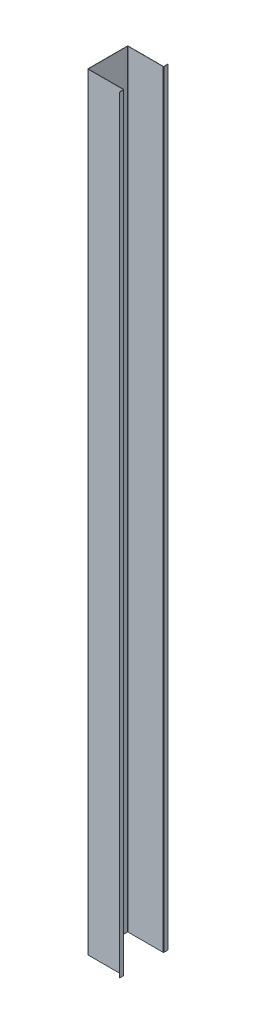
ISO-10303-21;
HEADER;
FILE_DESCRIPTION(('STEP AP214'),'2;1');
FILE_NAME('part.step','',(''),(''),'','','');
FILE_SCHEMA(('AUTOMOTIVE_DESIGN { 1 0 10303 214 1 1 1 1 }'));
ENDSEC;
DATA;
#1=APPLICATION_CONTEXT('core data for automotive mechanical design processes');
#2=APPLICATION_PROTOCOL_DEFINITION('international standard','automotive_design',2000,#1);
#3=PRODUCT_CONTEXT('',#1,'mechanical');
#4=PRODUCT('Part','Part','',(#3));
#5=PRODUCT_RELATED_PRODUCT_CATEGORY('part','',(#4));
#6=PRODUCT_DEFINITION_FORMATION('','',#4);
#7=PRODUCT_DEFINITION_CONTEXT('part definition',#1,'design');
#8=PRODUCT_DEFINITION('design','',#6,#7);
#9=PRODUCT_DEFINITION_SHAPE('','',#8);
#10=(LENGTH_UNIT() NAMED_UNIT(*) SI_UNIT(.MILLI.,.METRE.));
#11=(NAMED_UNIT(*) PLANE_ANGLE_UNIT() SI_UNIT($,.RADIAN.));
#12=(NAMED_UNIT(*) SI_UNIT($,.STERADIAN.) SOLID_ANGLE_UNIT());
#13=UNCERTAINTY_MEASURE_WITH_UNIT(LENGTH_MEASURE(1.E-05),#10,'distance_accuracy_value','');
#14=(GEOMETRIC_REPRESENTATION_CONTEXT(3) GLOBAL_UNCERTAINTY_ASSIGNED_CONTEXT((#13)) GLOBAL_UNIT_ASSIGNED_CONTEXT((#10,
#11,#12)) REPRESENTATION_CONTEXT('',''));
#15=CARTESIAN_POINT('',(0.,0.,0.));
#16=DIRECTION('',(0.,0.,1.));
#17=DIRECTION('',(1.,0.,0.));
#18=AXIS2_PLACEMENT_3D('',#15,#16,#17);
#19=CARTESIAN_POINT('',(-91.9999999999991,-962.599999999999,-0.6));
#20=DIRECTION('',(0.,-1.,0.));
#21=DIRECTION('',(0.,0.,-1.));
#22=AXIS2_PLACEMENT_3D('',#19,#20,#21);
#23=PLANE('',#22);
#24=DIRECTION('',(1.,0.,0.));
#25=VECTOR('',#24,1.);
#26=CARTESIAN_POINT('',(-91.9999999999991,-962.599999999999,-0.6));
#27=LINE('',#26,#25);
#28=CARTESIAN_POINT('',(-90.3999999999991,-962.599999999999,-0.600000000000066));
#29=VERTEX_POINT('',#28);
#30=CARTESIAN_POINT('',(-2.79999999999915,-962.599999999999,-0.599999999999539));
#31=VERTEX_POINT('',#30);
#32=EDGE_CURVE('E126',#29,#31,#27,.T.);
#33=ORIENTED_EDGE('',*,*,#32,.T.);
#34=DIRECTION('',(-3.00540842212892E-13,0.,1.));
#35=VECTOR('',#34,1.);
#36=CARTESIAN_POINT('',(-2.79999999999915,-962.599999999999,-0.599999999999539));
#37=LINE('',#36,#35);
#38=CARTESIAN_POINT('',(-2.79999999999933,-962.599999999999,4.61436444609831E-13));
#39=VERTEX_POINT('',#38);
#40=EDGE_CURVE('E306',#31,#39,#37,.T.);
#41=ORIENTED_EDGE('',*,*,#40,.T.);
#42=DIRECTION('',(1.,0.,0.));
#43=VECTOR('',#42,1.);
#44=CARTESIAN_POINT('',(-91.9999999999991,-962.599999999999,0.));
#45=LINE('',#44,#43);
#46=CARTESIAN_POINT('',(-90.3999999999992,-962.599999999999,0.));
#47=VERTEX_POINT('',#46);
#48=EDGE_CURVE('E455',#47,#39,#45,.T.);
#49=ORIENTED_EDGE('',*,*,#48,.F.);
#50=DIRECTION('',(1.11022302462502E-13,0.,-1.));
#51=VECTOR('',#50,1.);
#52=CARTESIAN_POINT('',(-90.3999999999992,-962.599999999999,0.));
#53=LINE('',#52,#51);
#54=EDGE_CURVE('E441',#47,#29,#53,.T.);
#55=ORIENTED_EDGE('',*,*,#54,.T.);
#56=EDGE_LOOP('',(#33,#41,#49,#55));
#57=FACE_BOUND('',#56,.T.);
#58=ADVANCED_FACE('F118',(#57),#23,.T.);
#59=CARTESIAN_POINT('',(0.,0.,-0.6));
#60=DIRECTION('',(0.,0.,1.));
#61=DIRECTION('',(1.,0.,0.));
#62=AXIS2_PLACEMENT_3D('',#59,#60,#61);
#63=PLANE('',#62);
#64=DIRECTION('',(0.,-1.,0.));
#65=VECTOR('',#64,1.);
#66=CARTESIAN_POINT('',(-2.79999999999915,-962.599999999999,-0.599999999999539));
#67=LINE('',#66,#65);
#68=CARTESIAN_POINT('',(-2.79999999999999,967.6,-0.599999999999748));
#69=VERTEX_POINT('',#68);
#70=EDGE_CURVE('E312',#31,#69,#67,.F.);
#71=ORIENTED_EDGE('',*,*,#70,.F.);
#72=ORIENTED_EDGE('',*,*,#32,.F.);
#73=DIRECTION('',(0.,-1.,0.));
#74=VECTOR('',#73,1.);
#75=CARTESIAN_POINT('',(-90.3999999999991,-962.599999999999,-0.600000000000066));
#76=LINE('',#75,#74);
#77=CARTESIAN_POINT('',(-90.3999999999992,967.6,-0.6));
#78=VERTEX_POINT('',#77);
#79=EDGE_CURVE('E434',#29,#78,#76,.F.);
#80=ORIENTED_EDGE('',*,*,#79,.T.);
#81=DIRECTION('',(-1.,0.,0.));
#82=VECTOR('',#81,1.);
#83=CARTESIAN_POINT('',(-91.9999999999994,967.6,-0.6));
#84=LINE('',#83,#82);
#85=EDGE_CURVE('E13',#69,#78,#84,.T.);
#86=ORIENTED_EDGE('',*,*,#85,.F.);
#87=EDGE_LOOP('',(#71,#72,#80,#86));
#88=FACE_BOUND('',#87,.T.);
#89=ADVANCED_FACE('F529',(#88),#63,.F.);
#90=CARTESIAN_POINT('',(0.,0.,0.));
#91=DIRECTION('',(0.,0.,1.));
#92=DIRECTION('',(1.,0.,0.));
#93=AXIS2_PLACEMENT_3D('',#90,#91,#92);
#94=PLANE('',#93);
#95=ORIENTED_EDGE('',*,*,#48,.T.);
#96=DIRECTION('',(0.,-1.,0.));
#97=VECTOR('',#96,1.);
#98=CARTESIAN_POINT('',(-2.79999999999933,-962.599999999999,4.61436444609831E-13));
#99=LINE('',#98,#97);
#100=CARTESIAN_POINT('',(-2.79999999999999,967.6,0.));
#101=VERTEX_POINT('',#100);
#102=EDGE_CURVE('E299',#39,#101,#99,.F.);
#103=ORIENTED_EDGE('',*,*,#102,.T.);
#104=DIRECTION('',(-1.,0.,0.));
#105=VECTOR('',#104,1.);
#106=CARTESIAN_POINT('',(-91.9999999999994,967.6,0.));
#107=LINE('',#106,#105);
#108=CARTESIAN_POINT('',(-90.3999999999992,967.6,0.));
#109=VERTEX_POINT('',#108);
#110=EDGE_CURVE('E121',#101,#109,#107,.T.);
#111=ORIENTED_EDGE('',*,*,#110,.T.);
#112=DIRECTION('',(0.,-1.,0.));
#113=VECTOR('',#112,1.);
#114=CARTESIAN_POINT('',(-90.3999999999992,-962.599999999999,0.));
#115=LINE('',#114,#113);
#116=EDGE_CURVE('E447',#47,#109,#115,.F.);
#117=ORIENTED_EDGE('',*,*,#116,.F.);
#118=EDGE_LOOP('',(#95,#103,#111,#117));
#119=FACE_BOUND('',#118,.T.);
#120=ADVANCED_FACE('F464',(#119),#94,.T.);
#121=CARTESIAN_POINT('',(-1.19999999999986,-962.599999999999,100.200000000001));
#122=DIRECTION('',(0.,1.,0.));
#123=DIRECTION('',(0.,0.,1.));
#124=AXIS2_PLACEMENT_3D('',#121,#122,#123);
#125=PLANE('',#124);
#126=DIRECTION('',(-1.11022302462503E-13,0.,-1.));
#127=VECTOR('',#126,1.);
#128=CARTESIAN_POINT('',(-2.80000000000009,-962.599999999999,100.200000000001));
#129=LINE('',#128,#127);
#130=CARTESIAN_POINT('',(-2.80000000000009,-962.599999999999,100.200000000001));
#131=VERTEX_POINT('',#130);
#132=CARTESIAN_POINT('',(-2.80000000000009,-962.599999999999,99.6000000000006));
#133=VERTEX_POINT('',#132);
#134=EDGE_CURVE('E368',#131,#133,#129,.T.);
#135=ORIENTED_EDGE('',*,*,#134,.F.);
#136=DIRECTION('',(1.,0.,0.));
#137=VECTOR('',#136,1.);
#138=CARTESIAN_POINT('',(-6.95830423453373E-13,-962.599999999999,100.200000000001));
#139=LINE('',#138,#137);
#140=CARTESIAN_POINT('',(-90.3999999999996,-962.599999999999,100.2));
#141=VERTEX_POINT('',#140);
#142=EDGE_CURVE('E376',#141,#131,#139,.T.);
#143=ORIENTED_EDGE('',*,*,#142,.F.);
#144=DIRECTION('',(0.,0.,-1.));
#145=VECTOR('',#144,1.);
#146=CARTESIAN_POINT('',(-90.3999999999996,-962.599999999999,99.6));
#147=LINE('',#146,#145);
#148=CARTESIAN_POINT('',(-90.3999999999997,-962.599999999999,99.6));
#149=VERTEX_POINT('',#148);
#150=EDGE_CURVE('E387',#149,#141,#147,.F.);
#151=ORIENTED_EDGE('',*,*,#150,.F.);
#152=DIRECTION('',(-1.,0.,0.));
#153=VECTOR('',#152,1.);
#154=CARTESIAN_POINT('',(-1.19999999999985,-962.599999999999,99.6000000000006));
#155=LINE('',#154,#153);
#156=EDGE_CURVE('E381',#149,#133,#155,.F.);
#157=ORIENTED_EDGE('',*,*,#156,.T.);
#158=EDGE_LOOP('',(#135,#143,#151,#157));
#159=FACE_BOUND('',#158,.T.);
#160=ADVANCED_FACE('F506',(#159),#125,.F.);
#161=CARTESIAN_POINT('',(-91.3999999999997,967.6,100.2));
#162=DIRECTION('',(0.,-1.,0.));
#163=DIRECTION('',(1.,0.,0.));
#164=AXIS2_PLACEMENT_3D('',#161,#162,#163);
#165=PLANE('',#164);
#166=DIRECTION('',(-1.11022302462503E-13,0.,-1.));
#167=VECTOR('',#166,1.);
#168=CARTESIAN_POINT('',(-2.80000000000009,967.6,100.200000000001));
#169=LINE('',#168,#167);
#170=CARTESIAN_POINT('',(-2.80000000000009,967.6,100.200000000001));
#171=VERTEX_POINT('',#170);
#172=CARTESIAN_POINT('',(-2.80000000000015,967.6,99.6000000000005));
#173=VERTEX_POINT('',#172);
#174=EDGE_CURVE('E358',#171,#173,#169,.T.);
#175=ORIENTED_EDGE('',*,*,#174,.T.);
#176=DIRECTION('',(1.,0.,0.));
#177=VECTOR('',#176,1.);
#178=CARTESIAN_POINT('',(-91.3999999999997,967.6,99.6));
#179=LINE('',#178,#177);
#180=CARTESIAN_POINT('',(-90.3999999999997,967.6,99.6));
#181=VERTEX_POINT('',#180);
#182=EDGE_CURVE('E379',#173,#181,#179,.F.);
#183=ORIENTED_EDGE('',*,*,#182,.T.);
#184=DIRECTION('',(0.,0.,-1.));
#185=VECTOR('',#184,1.);
#186=CARTESIAN_POINT('',(-90.3999999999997,967.6,100.2));
#187=LINE('',#186,#185);
#188=CARTESIAN_POINT('',(-90.3999999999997,967.6,100.2));
#189=VERTEX_POINT('',#188);
#190=EDGE_CURVE('E370',#181,#189,#187,.F.);
#191=ORIENTED_EDGE('',*,*,#190,.T.);
#192=DIRECTION('',(-1.,0.,0.));
#193=VECTOR('',#192,1.);
#194=CARTESIAN_POINT('',(-3.07776345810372E-12,967.6,100.200000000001));
#195=LINE('',#194,#193);
#196=EDGE_CURVE('E373',#171,#189,#195,.T.);
#197=ORIENTED_EDGE('',*,*,#196,.F.);
#198=EDGE_LOOP('',(#175,#183,#191,#197));
#199=FACE_BOUND('',#198,.T.);
#200=ADVANCED_FACE('F493',(#199),#165,.F.);
#201=CARTESIAN_POINT('',(-6.95830423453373E-13,0.,100.200000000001));
#202=DIRECTION('',(0.,0.,-1.));
#203=DIRECTION('',(-1.,0.,0.));
#204=AXIS2_PLACEMENT_3D('',#201,#202,#203);
#205=PLANE('',#204);
#206=DIRECTION('',(0.,1.,0.));
#207=VECTOR('',#206,1.);
#208=CARTESIAN_POINT('',(-2.80000000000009,967.6,100.200000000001));
#209=LINE('',#208,#207);
#210=EDGE_CURVE('E364',#171,#131,#209,.F.);
#211=ORIENTED_EDGE('',*,*,#210,.F.);
#212=ORIENTED_EDGE('',*,*,#196,.T.);
#213=DIRECTION('',(0.,-1.,0.));
#214=VECTOR('',#213,1.);
#215=CARTESIAN_POINT('',(-90.3999999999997,967.6,100.2));
#216=LINE('',#215,#214);
#217=EDGE_CURVE('E384',#141,#189,#216,.F.);
#218=ORIENTED_EDGE('',*,*,#217,.F.);
#219=ORIENTED_EDGE('',*,*,#142,.T.);
#220=EDGE_LOOP('',(#211,#212,#218,#219));
#221=FACE_BOUND('',#220,.T.);
#222=ADVANCED_FACE('F509',(#221),#205,.F.);
#223=CARTESIAN_POINT('',(-6.91658021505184E-13,0.,99.6000000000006));
#224=DIRECTION('',(0.,0.,-1.));
#225=DIRECTION('',(-1.,0.,0.));
#226=AXIS2_PLACEMENT_3D('',#223,#224,#225);
#227=PLANE('',#226);
#228=ORIENTED_EDGE('',*,*,#182,.F.);
#229=DIRECTION('',(0.,1.,0.));
#230=VECTOR('',#229,1.);
#231=CARTESIAN_POINT('',(-2.80000000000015,967.6,99.6000000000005));
#232=LINE('',#231,#230);
#233=EDGE_CURVE('E353',#173,#133,#232,.F.);
#234=ORIENTED_EDGE('',*,*,#233,.T.);
#235=ORIENTED_EDGE('',*,*,#156,.F.);
#236=DIRECTION('',(0.,-1.,0.));
#237=VECTOR('',#236,1.);
#238=CARTESIAN_POINT('',(-90.3999999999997,967.6,99.6));
#239=LINE('',#238,#237);
#240=EDGE_CURVE('E390',#181,#149,#239,.T.);
#241=ORIENTED_EDGE('',*,*,#240,.F.);
#242=EDGE_LOOP('',(#228,#234,#235,#241));
#243=FACE_BOUND('',#242,.T.);
#244=ADVANCED_FACE('F496',(#243),#227,.T.);
#245=CARTESIAN_POINT('',(-91.9999999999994,967.6,0.));
#246=DIRECTION('',(0.,-1.,0.));
#247=DIRECTION('',(1.,0.,0.));
#248=AXIS2_PLACEMENT_3D('',#245,#246,#247);
#249=PLANE('',#248);
#250=DIRECTION('',(-1.,0.,0.));
#251=VECTOR('',#250,1.);
#252=CARTESIAN_POINT('',(-91.3999999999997,967.6,98.6));
#253=LINE('',#252,#251);
#254=CARTESIAN_POINT('',(-91.3999999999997,967.6,98.6));
#255=VERTEX_POINT('',#254);
#256=CARTESIAN_POINT('',(-91.9999999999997,967.6,98.6));
#257=VERTEX_POINT('',#256);
#258=EDGE_CURVE('E409',#255,#257,#253,.T.);
#259=ORIENTED_EDGE('',*,*,#258,.F.);
#260=DIRECTION('',(0.,0.,1.));
#261=VECTOR('',#260,1.);
#262=CARTESIAN_POINT('',(-91.3999999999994,967.6,0.));
#263=LINE('',#262,#261);
#264=CARTESIAN_POINT('',(-91.3999999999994,967.6,1.00000000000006));
#265=VERTEX_POINT('',#264);
#266=EDGE_CURVE('E422',#255,#265,#263,.F.);
#267=ORIENTED_EDGE('',*,*,#266,.T.);
#268=DIRECTION('',(1.,0.,0.));
#269=VECTOR('',#268,1.);
#270=CARTESIAN_POINT('',(-91.9999999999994,967.6,0.999999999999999));
#271=LINE('',#270,#269);
#272=CARTESIAN_POINT('',(-91.9999999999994,967.6,1.00000000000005));
#273=VERTEX_POINT('',#272);
#274=EDGE_CURVE('E412',#265,#273,#271,.F.);
#275=ORIENTED_EDGE('',*,*,#274,.T.);
#276=DIRECTION('',(0.,0.,-1.));
#277=VECTOR('',#276,1.);
#278=CARTESIAN_POINT('',(-91.9999999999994,967.6,-3.20646904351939E-13));
#279=LINE('',#278,#277);
#280=EDGE_CURVE('E418',#257,#273,#279,.T.);
#281=ORIENTED_EDGE('',*,*,#280,.F.);
#282=EDGE_LOOP('',(#259,#267,#275,#281));
#283=FACE_BOUND('',#282,.T.);
#284=ADVANCED_FACE('F480',(#283),#249,.F.);
#285=CARTESIAN_POINT('',(-91.9999999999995,-962.599999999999,100.2));
#286=DIRECTION('',(0.,1.,0.));
#287=DIRECTION('',(-1.,0.,0.));
#288=AXIS2_PLACEMENT_3D('',#285,#286,#287);
#289=PLANE('',#288);
#290=DIRECTION('',(-1.,0.,0.));
#291=VECTOR('',#290,1.);
#292=CARTESIAN_POINT('',(-91.3999999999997,-962.599999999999,98.6));
#293=LINE('',#292,#291);
#294=CARTESIAN_POINT('',(-91.3999999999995,-962.599999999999,98.6));
#295=VERTEX_POINT('',#294);
#296=CARTESIAN_POINT('',(-91.9999999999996,-962.599999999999,98.6));
#297=VERTEX_POINT('',#296);
#298=EDGE_CURVE('E400',#295,#297,#293,.T.);
#299=ORIENTED_EDGE('',*,*,#298,.T.);
#300=DIRECTION('',(0.,0.,1.));
#301=VECTOR('',#300,1.);
#302=CARTESIAN_POINT('',(-91.9999999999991,-962.599999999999,-3.20646904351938E-13));
#303=LINE('',#302,#301);
#304=CARTESIAN_POINT('',(-91.9999999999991,-962.599999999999,1.00000000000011));
#305=VERTEX_POINT('',#304);
#306=EDGE_CURVE('E415',#305,#297,#303,.T.);
#307=ORIENTED_EDGE('',*,*,#306,.F.);
#308=DIRECTION('',(1.,0.,0.));
#309=VECTOR('',#308,1.);
#310=CARTESIAN_POINT('',(-91.3999999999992,-962.599999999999,1.00000000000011));
#311=LINE('',#310,#309);
#312=CARTESIAN_POINT('',(-91.3999999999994,-962.599999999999,1.00000000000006));
#313=VERTEX_POINT('',#312);
#314=EDGE_CURVE('E427',#313,#305,#311,.F.);
#315=ORIENTED_EDGE('',*,*,#314,.F.);
#316=DIRECTION('',(0.,0.,-1.));
#317=VECTOR('',#316,1.);
#318=CARTESIAN_POINT('',(-91.3999999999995,-962.599999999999,100.2));
#319=LINE('',#318,#317);
#320=EDGE_CURVE('E420',#313,#295,#319,.F.);
#321=ORIENTED_EDGE('',*,*,#320,.T.);
#322=EDGE_LOOP('',(#299,#307,#315,#321));
#323=FACE_BOUND('',#322,.T.);
#324=ADVANCED_FACE('F519',(#323),#289,.F.);
#325=CARTESIAN_POINT('',(-91.9999999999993,0.,-3.20646904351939E-13));
#326=DIRECTION('',(1.,0.,0.));
#327=DIRECTION('',(0.,0.,-1.));
#328=AXIS2_PLACEMENT_3D('',#325,#326,#327);
#329=PLANE('',#328);
#330=DIRECTION('',(0.,-1.,0.));
#331=VECTOR('',#330,1.);
#332=CARTESIAN_POINT('',(-91.9999999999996,-962.599999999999,98.6));
#333=LINE('',#332,#331);
#334=EDGE_CURVE('E394',#297,#257,#333,.F.);
#335=ORIENTED_EDGE('',*,*,#334,.T.);
#336=ORIENTED_EDGE('',*,*,#280,.T.);
#337=DIRECTION('',(0.,-1.,0.));
#338=VECTOR('',#337,1.);
#339=CARTESIAN_POINT('',(-91.9999999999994,967.6,0.999999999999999));
#340=LINE('',#339,#338);
#341=EDGE_CURVE('E424',#305,#273,#340,.F.);
#342=ORIENTED_EDGE('',*,*,#341,.F.);
#343=ORIENTED_EDGE('',*,*,#306,.T.);
#344=EDGE_LOOP('',(#335,#336,#342,#343));
#345=FACE_BOUND('',#344,.T.);
#346=ADVANCED_FACE('F514',(#345),#329,.F.);
#347=CARTESIAN_POINT('',(-91.3999999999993,0.,-3.18552015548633E-13));
#348=DIRECTION('',(1.,0.,0.));
#349=DIRECTION('',(0.,0.,-1.));
#350=AXIS2_PLACEMENT_3D('',#347,#348,#349);
#351=PLANE('',#350);
#352=ORIENTED_EDGE('',*,*,#266,.F.);
#353=DIRECTION('',(0.,-1.,0.));
#354=VECTOR('',#353,1.);
#355=CARTESIAN_POINT('',(-91.3999999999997,-962.599999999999,98.6));
#356=LINE('',#355,#354);
#357=EDGE_CURVE('E142',#295,#255,#356,.F.);
#358=ORIENTED_EDGE('',*,*,#357,.F.);
#359=ORIENTED_EDGE('',*,*,#320,.F.);
#360=DIRECTION('',(0.,-1.,0.));
#361=VECTOR('',#360,1.);
#362=CARTESIAN_POINT('',(-91.3999999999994,967.6,1.));
#363=LINE('',#362,#361);
#364=EDGE_CURVE('E430',#265,#313,#363,.T.);
#365=ORIENTED_EDGE('',*,*,#364,.F.);
#366=EDGE_LOOP('',(#352,#358,#359,#365));
#367=FACE_BOUND('',#366,.T.);
#368=ADVANCED_FACE('F481',(#367),#351,.T.);
#369=CARTESIAN_POINT('',(-91.9999999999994,967.6,-0.6));
#370=DIRECTION('',(0.,1.,0.));
#371=DIRECTION('',(0.,0.,1.));
#372=AXIS2_PLACEMENT_3D('',#369,#370,#371);
#373=PLANE('',#372);
#374=DIRECTION('',(-3.00454106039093E-13,0.,1.));
#375=VECTOR('',#374,1.);
#376=CARTESIAN_POINT('',(-2.79999999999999,967.6,-0.599999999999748));
#377=LINE('',#376,#375);
#378=EDGE_CURVE('E317',#69,#101,#377,.T.);
#379=ORIENTED_EDGE('',*,*,#378,.F.);
#380=ORIENTED_EDGE('',*,*,#85,.T.);
#381=DIRECTION('',(1.11022302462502E-13,0.,-1.));
#382=VECTOR('',#381,1.);
#383=CARTESIAN_POINT('',(-90.3999999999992,967.6,0.));
#384=LINE('',#383,#382);
#385=EDGE_CURVE('E452',#109,#78,#384,.T.);
#386=ORIENTED_EDGE('',*,*,#385,.F.);
#387=ORIENTED_EDGE('',*,*,#110,.F.);
#388=EDGE_LOOP('',(#379,#380,#386,#387));
#389=FACE_BOUND('',#388,.T.);
#390=ADVANCED_FACE('F467',(#389),#373,.T.);
#391=CARTESIAN_POINT('',(-90.3999999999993,967.6,1.00000000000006));
#392=DIRECTION('',(0.,1.,0.));
#393=DIRECTION('',(0.,0.,1.));
#394=AXIS2_PLACEMENT_3D('',#391,#392,#393);
#395=PLANE('',#394);
#396=ORIENTED_EDGE('',*,*,#274,.F.);
#397=CARTESIAN_POINT('',(-90.3999999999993,967.6,1.00000000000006));
#398=DIRECTION('',(0.,-1.,0.));
#399=DIRECTION('',(0.,0.,-1.));
#400=AXIS2_PLACEMENT_3D('',#397,#398,#399);
#401=CIRCLE('',#400,1.00000000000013);
#402=EDGE_CURVE('E444',#109,#265,#401,.F.);
#403=ORIENTED_EDGE('',*,*,#402,.F.);
#404=ORIENTED_EDGE('',*,*,#385,.T.);
#405=CARTESIAN_POINT('',(-90.3999999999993,967.6,1.00000000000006));
#406=DIRECTION('',(0.,-1.,0.));
#407=DIRECTION('',(0.,0.,-1.));
#408=AXIS2_PLACEMENT_3D('',#405,#406,#407);
#409=CIRCLE('',#408,1.60000000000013);
#410=EDGE_CURVE('E437',#78,#273,#409,.F.);
#411=ORIENTED_EDGE('',*,*,#410,.T.);
#412=EDGE_LOOP('',(#396,#403,#404,#411));
#413=FACE_BOUND('',#412,.T.);
#414=ADVANCED_FACE('F477',(#413),#395,.T.);
#415=CARTESIAN_POINT('',(-90.3999999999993,-962.599999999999,1.00000000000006));
#416=DIRECTION('',(0.,1.,0.));
#417=DIRECTION('',(0.,0.,1.));
#418=AXIS2_PLACEMENT_3D('',#415,#416,#417);
#419=PLANE('',#418);
#420=CARTESIAN_POINT('',(-90.3999999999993,-962.599999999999,1.00000000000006));
#421=DIRECTION('',(0.,-1.,0.));
#422=DIRECTION('',(0.,0.,-1.));
#423=AXIS2_PLACEMENT_3D('',#420,#421,#422);
#424=CIRCLE('',#423,1.00000000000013);
#425=EDGE_CURVE('E417',#313,#47,#424,.T.);
#426=ORIENTED_EDGE('',*,*,#425,.F.);
#427=ORIENTED_EDGE('',*,*,#314,.T.);
#428=CARTESIAN_POINT('',(-90.3999999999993,-962.599999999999,1.00000000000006));
#429=DIRECTION('',(0.,-1.,0.));
#430=DIRECTION('',(0.,0.,-1.));
#431=AXIS2_PLACEMENT_3D('',#428,#429,#430);
#432=CIRCLE('',#431,1.60000000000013);
#433=EDGE_CURVE('E438',#305,#29,#432,.T.);
#434=ORIENTED_EDGE('',*,*,#433,.T.);
#435=ORIENTED_EDGE('',*,*,#54,.F.);
#436=EDGE_LOOP('',(#426,#427,#434,#435));
#437=FACE_BOUND('',#436,.T.);
#438=ADVANCED_FACE('F521',(#437),#419,.F.);
#439=CARTESIAN_POINT('',(-90.3999999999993,-962.599999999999,1.00000000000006));
#440=DIRECTION('',(0.,-1.,0.));
#441=DIRECTION('',(-1.,0.,0.));
#442=AXIS2_PLACEMENT_3D('',#439,#440,#441);
#443=CYLINDRICAL_SURFACE('',#442,1.60000000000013);
#444=ORIENTED_EDGE('',*,*,#79,.F.);
#445=ORIENTED_EDGE('',*,*,#433,.F.);
#446=ORIENTED_EDGE('',*,*,#341,.T.);
#447=ORIENTED_EDGE('',*,*,#410,.F.);
#448=EDGE_LOOP('',(#444,#445,#446,#447));
#449=FACE_BOUND('',#448,.T.);
#450=ADVANCED_FACE('F526',(#449),#443,.T.);
#451=CARTESIAN_POINT('',(-90.3999999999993,-962.599999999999,1.00000000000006));
#452=DIRECTION('',(0.,-1.,0.));
#453=DIRECTION('',(-1.,0.,0.));
#454=AXIS2_PLACEMENT_3D('',#451,#452,#453);
#455=CYLINDRICAL_SURFACE('',#454,1.00000000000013);
#456=ORIENTED_EDGE('',*,*,#116,.T.);
#457=ORIENTED_EDGE('',*,*,#402,.T.);
#458=ORIENTED_EDGE('',*,*,#364,.T.);
#459=ORIENTED_EDGE('',*,*,#425,.T.);
#460=EDGE_LOOP('',(#456,#457,#458,#459));
#461=FACE_BOUND('',#460,.T.);
#462=ADVANCED_FACE('F473',(#461),#455,.F.);
#463=CARTESIAN_POINT('',(-90.3999999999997,967.6,98.6));
#464=DIRECTION('',(0.,1.,0.));
#465=DIRECTION('',(0.,0.,1.));
#466=AXIS2_PLACEMENT_3D('',#463,#464,#465);
#467=PLANE('',#466);
#468=ORIENTED_EDGE('',*,*,#190,.F.);
#469=CARTESIAN_POINT('',(-90.3999999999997,967.6,98.6));
#470=DIRECTION('',(0.,-1.,0.));
#471=DIRECTION('',(0.,0.,-1.));
#472=AXIS2_PLACEMENT_3D('',#469,#470,#471);
#473=CIRCLE('',#472,1.);
#474=EDGE_CURVE('E403',#255,#181,#473,.F.);
#475=ORIENTED_EDGE('',*,*,#474,.F.);
#476=ORIENTED_EDGE('',*,*,#258,.T.);
#477=CARTESIAN_POINT('',(-90.3999999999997,967.6,98.6));
#478=DIRECTION('',(0.,-1.,0.));
#479=DIRECTION('',(0.,0.,-1.));
#480=AXIS2_PLACEMENT_3D('',#477,#478,#479);
#481=CIRCLE('',#480,1.6);
#482=EDGE_CURVE('E396',#257,#189,#481,.F.);
#483=ORIENTED_EDGE('',*,*,#482,.T.);
#484=EDGE_LOOP('',(#468,#475,#476,#483));
#485=FACE_BOUND('',#484,.T.);
#486=ADVANCED_FACE('F489',(#485),#467,.T.);
#487=CARTESIAN_POINT('',(-90.3999999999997,-962.599999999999,98.6));
#488=DIRECTION('',(0.,1.,0.));
#489=DIRECTION('',(0.,0.,1.));
#490=AXIS2_PLACEMENT_3D('',#487,#488,#489);
#491=PLANE('',#490);
#492=CARTESIAN_POINT('',(-90.3999999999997,-962.599999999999,98.6));
#493=DIRECTION('',(0.,-1.,0.));
#494=DIRECTION('',(0.,0.,-1.));
#495=AXIS2_PLACEMENT_3D('',#492,#493,#494);
#496=CIRCLE('',#495,1.);
#497=EDGE_CURVE('E375',#149,#295,#496,.T.);
#498=ORIENTED_EDGE('',*,*,#497,.F.);
#499=ORIENTED_EDGE('',*,*,#150,.T.);
#500=CARTESIAN_POINT('',(-90.3999999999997,-962.599999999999,98.6));
#501=DIRECTION('',(0.,-1.,0.));
#502=DIRECTION('',(0.,0.,-1.));
#503=AXIS2_PLACEMENT_3D('',#500,#501,#502);
#504=CIRCLE('',#503,1.6);
#505=EDGE_CURVE('E397',#141,#297,#504,.T.);
#506=ORIENTED_EDGE('',*,*,#505,.T.);
#507=ORIENTED_EDGE('',*,*,#298,.F.);
#508=EDGE_LOOP('',(#498,#499,#506,#507));
#509=FACE_BOUND('',#508,.T.);
#510=ADVANCED_FACE('F501',(#509),#491,.F.);
#511=CARTESIAN_POINT('',(-90.3999999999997,-962.599999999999,98.6));
#512=DIRECTION('',(0.,-1.,0.));
#513=DIRECTION('',(0.,0.,1.));
#514=AXIS2_PLACEMENT_3D('',#511,#512,#513);
#515=CYLINDRICAL_SURFACE('',#514,1.6);
#516=ORIENTED_EDGE('',*,*,#334,.F.);
#517=ORIENTED_EDGE('',*,*,#505,.F.);
#518=ORIENTED_EDGE('',*,*,#217,.T.);
#519=ORIENTED_EDGE('',*,*,#482,.F.);
#520=EDGE_LOOP('',(#516,#517,#518,#519));
#521=FACE_BOUND('',#520,.T.);
#522=ADVANCED_FACE('F512',(#521),#515,.T.);
#523=CARTESIAN_POINT('',(-90.3999999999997,-962.599999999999,98.6));
#524=DIRECTION('',(0.,-1.,0.));
#525=DIRECTION('',(0.,0.,1.));
#526=AXIS2_PLACEMENT_3D('',#523,#524,#525);
#527=CYLINDRICAL_SURFACE('',#526,1.);
#528=ORIENTED_EDGE('',*,*,#357,.T.);
#529=ORIENTED_EDGE('',*,*,#474,.T.);
#530=ORIENTED_EDGE('',*,*,#240,.T.);
#531=ORIENTED_EDGE('',*,*,#497,.T.);
#532=EDGE_LOOP('',(#528,#529,#530,#531));
#533=FACE_BOUND('',#532,.T.);
#534=ADVANCED_FACE('F484',(#533),#527,.F.);
#535=CARTESIAN_POINT('',(-2.79999999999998,-962.599999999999,101.200000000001));
#536=DIRECTION('',(0.,-1.,0.));
#537=DIRECTION('',(0.,0.,-1.));
#538=AXIS2_PLACEMENT_3D('',#535,#536,#537);
#539=PLANE('',#538);
#540=DIRECTION('',(-1.,0.,0.));
#541=VECTOR('',#540,1.);
#542=CARTESIAN_POINT('',(-1.19999999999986,-962.599999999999,101.200000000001));
#543=LINE('',#542,#541);
#544=CARTESIAN_POINT('',(-1.79999999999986,-962.599999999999,101.200000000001));
#545=VERTEX_POINT('',#544);
#546=CARTESIAN_POINT('',(-1.19999999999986,-962.599999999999,101.200000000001));
#547=VERTEX_POINT('',#546);
#548=EDGE_CURVE('E320',#545,#547,#543,.F.);
#549=ORIENTED_EDGE('',*,*,#548,.F.);
#550=CARTESIAN_POINT('',(-2.79999999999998,-962.599999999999,101.200000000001));
#551=DIRECTION('',(0.,1.,0.));
#552=DIRECTION('',(0.,0.,1.));
#553=AXIS2_PLACEMENT_3D('',#550,#551,#552);
#554=CIRCLE('',#553,1.00000000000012);
#555=EDGE_CURVE('E361',#131,#545,#554,.F.);
#556=ORIENTED_EDGE('',*,*,#555,.F.);
#557=ORIENTED_EDGE('',*,*,#134,.T.);
#558=CARTESIAN_POINT('',(-2.79999999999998,-962.599999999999,101.200000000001));
#559=DIRECTION('',(0.,1.,0.));
#560=DIRECTION('',(0.,0.,1.));
#561=AXIS2_PLACEMENT_3D('',#558,#559,#560);
#562=CIRCLE('',#561,1.60000000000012);
#563=EDGE_CURVE('E134',#133,#547,#562,.F.);
#564=ORIENTED_EDGE('',*,*,#563,.T.);
#565=EDGE_LOOP('',(#549,#556,#557,#564));
#566=FACE_BOUND('',#565,.T.);
#567=ADVANCED_FACE('F597',(#566),#539,.T.);
#568=CARTESIAN_POINT('',(-2.79999999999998,967.6,101.200000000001));
#569=DIRECTION('',(0.,-1.,0.));
#570=DIRECTION('',(0.,0.,-1.));
#571=AXIS2_PLACEMENT_3D('',#568,#569,#570);
#572=PLANE('',#571);
#573=CARTESIAN_POINT('',(-2.79999999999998,967.6,101.200000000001));
#574=DIRECTION('',(0.,1.,0.));
#575=DIRECTION('',(0.,0.,1.));
#576=AXIS2_PLACEMENT_3D('',#573,#574,#575);
#577=CIRCLE('',#576,1.00000000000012);
#578=CARTESIAN_POINT('',(-1.79999999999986,967.6,101.200000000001));
#579=VERTEX_POINT('',#578);
#580=EDGE_CURVE('E326',#579,#171,#577,.T.);
#581=ORIENTED_EDGE('',*,*,#580,.F.);
#582=DIRECTION('',(-1.,0.,0.));
#583=VECTOR('',#582,1.);
#584=CARTESIAN_POINT('',(-1.80000000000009,967.6,101.200000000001));
#585=LINE('',#584,#583);
#586=CARTESIAN_POINT('',(-1.20000000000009,967.6,101.200000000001));
#587=VERTEX_POINT('',#586);
#588=EDGE_CURVE('E346',#579,#587,#585,.F.);
#589=ORIENTED_EDGE('',*,*,#588,.T.);
#590=CARTESIAN_POINT('',(-2.79999999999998,967.6,101.200000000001));
#591=DIRECTION('',(0.,1.,0.));
#592=DIRECTION('',(0.,0.,1.));
#593=AXIS2_PLACEMENT_3D('',#590,#591,#592);
#594=CIRCLE('',#593,1.60000000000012);
#595=EDGE_CURVE('E356',#587,#173,#594,.T.);
#596=ORIENTED_EDGE('',*,*,#595,.T.);
#597=ORIENTED_EDGE('',*,*,#174,.F.);
#598=EDGE_LOOP('',(#581,#589,#596,#597));
#599=FACE_BOUND('',#598,.T.);
#600=ADVANCED_FACE('F608',(#599),#572,.F.);
#601=CARTESIAN_POINT('',(-2.79999999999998,967.6,101.200000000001));
#602=DIRECTION('',(0.,1.,0.));
#603=DIRECTION('',(1.,0.,0.));
#604=AXIS2_PLACEMENT_3D('',#601,#602,#603);
#605=CYLINDRICAL_SURFACE('',#604,1.60000000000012);
#606=ORIENTED_EDGE('',*,*,#233,.F.);
#607=ORIENTED_EDGE('',*,*,#595,.F.);
#608=DIRECTION('',(0.,1.,0.));
#609=VECTOR('',#608,1.);
#610=CARTESIAN_POINT('',(-1.19999999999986,-962.599999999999,101.200000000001));
#611=LINE('',#610,#609);
#612=EDGE_CURVE('E344',#587,#547,#611,.F.);
#613=ORIENTED_EDGE('',*,*,#612,.T.);
#614=ORIENTED_EDGE('',*,*,#563,.F.);
#615=EDGE_LOOP('',(#606,#607,#613,#614));
#616=FACE_BOUND('',#615,.T.);
#617=ADVANCED_FACE('F611',(#616),#605,.T.);
#618=CARTESIAN_POINT('',(-2.79999999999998,967.6,101.200000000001));
#619=DIRECTION('',(0.,1.,0.));
#620=DIRECTION('',(1.,0.,0.));
#621=AXIS2_PLACEMENT_3D('',#618,#619,#620);
#622=CYLINDRICAL_SURFACE('',#621,1.00000000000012);
#623=ORIENTED_EDGE('',*,*,#210,.T.);
#624=ORIENTED_EDGE('',*,*,#555,.T.);
#625=DIRECTION('',(0.,1.,0.));
#626=VECTOR('',#625,1.);
#627=CARTESIAN_POINT('',(-1.79999999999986,-962.599999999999,101.200000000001));
#628=LINE('',#627,#626);
#629=EDGE_CURVE('E349',#545,#579,#628,.T.);
#630=ORIENTED_EDGE('',*,*,#629,.T.);
#631=ORIENTED_EDGE('',*,*,#580,.T.);
#632=EDGE_LOOP('',(#623,#624,#630,#631));
#633=FACE_BOUND('',#632,.T.);
#634=ADVANCED_FACE('F616',(#633),#622,.F.);
#635=CARTESIAN_POINT('',(-1.19999999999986,-962.599999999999,100.200000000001));
#636=DIRECTION('',(0.,1.,0.));
#637=DIRECTION('',(-1.,0.,0.));
#638=AXIS2_PLACEMENT_3D('',#635,#636,#637);
#639=PLANE('',#638);
#640=ORIENTED_EDGE('',*,*,#548,.T.);
#641=DIRECTION('',(0.,0.,-1.));
#642=VECTOR('',#641,1.);
#643=CARTESIAN_POINT('',(-1.19999999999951,-962.599999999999,0.));
#644=LINE('',#643,#642);
#645=CARTESIAN_POINT('',(-1.19999999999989,-962.599999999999,110.600000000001));
#646=VERTEX_POINT('',#645);
#647=EDGE_CURVE('E334',#646,#547,#644,.T.);
#648=ORIENTED_EDGE('',*,*,#647,.F.);
#649=DIRECTION('',(-1.,0.,0.));
#650=VECTOR('',#649,1.);
#651=CARTESIAN_POINT('',(-1.19999999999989,-962.599999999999,110.600000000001));
#652=LINE('',#651,#650);
#653=CARTESIAN_POINT('',(-1.79999999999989,-962.599999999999,110.600000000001));
#654=VERTEX_POINT('',#653);
#655=EDGE_CURVE('E327',#646,#654,#652,.T.);
#656=ORIENTED_EDGE('',*,*,#655,.T.);
#657=DIRECTION('',(0.,0.,1.));
#658=VECTOR('',#657,1.);
#659=CARTESIAN_POINT('',(-1.79999999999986,-962.599999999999,100.200000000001));
#660=LINE('',#659,#658);
#661=EDGE_CURVE('E341',#654,#545,#660,.F.);
#662=ORIENTED_EDGE('',*,*,#661,.T.);
#663=EDGE_LOOP('',(#640,#648,#656,#662));
#664=FACE_BOUND('',#663,.T.);
#665=ADVANCED_FACE('F619',(#664),#639,.F.);
#666=CARTESIAN_POINT('',(-1.20000000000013,967.6,110.600000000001));
#667=DIRECTION('',(0.,-1.,0.));
#668=DIRECTION('',(1.,0.,0.));
#669=AXIS2_PLACEMENT_3D('',#666,#667,#668);
#670=PLANE('',#669);
#671=ORIENTED_EDGE('',*,*,#588,.F.);
#672=DIRECTION('',(0.,0.,-1.));
#673=VECTOR('',#672,1.);
#674=CARTESIAN_POINT('',(-1.80000000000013,967.6,110.600000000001));
#675=LINE('',#674,#673);
#676=CARTESIAN_POINT('',(-1.80000000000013,967.6,110.600000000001));
#677=VERTEX_POINT('',#676);
#678=EDGE_CURVE('E339',#579,#677,#675,.F.);
#679=ORIENTED_EDGE('',*,*,#678,.T.);
#680=DIRECTION('',(-1.,0.,0.));
#681=VECTOR('',#680,1.);
#682=CARTESIAN_POINT('',(-1.20000000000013,967.6,110.600000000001));
#683=LINE('',#682,#681);
#684=CARTESIAN_POINT('',(-1.20000000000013,967.6,110.600000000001));
#685=VERTEX_POINT('',#684);
#686=EDGE_CURVE('E323',#685,#677,#683,.T.);
#687=ORIENTED_EDGE('',*,*,#686,.F.);
#688=DIRECTION('',(0.,0.,1.));
#689=VECTOR('',#688,1.);
#690=CARTESIAN_POINT('',(-1.19999999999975,967.6,0.));
#691=LINE('',#690,#689);
#692=EDGE_CURVE('E332',#587,#685,#691,.T.);
#693=ORIENTED_EDGE('',*,*,#692,.F.);
#694=EDGE_LOOP('',(#671,#679,#687,#693));
#695=FACE_BOUND('',#694,.T.);
#696=ADVANCED_FACE('F625',(#695),#670,.F.);
#697=CARTESIAN_POINT('',(-1.19999999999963,0.,0.));
#698=DIRECTION('',(-1.,0.,0.));
#699=DIRECTION('',(0.,0.,1.));
#700=AXIS2_PLACEMENT_3D('',#697,#698,#699);
#701=PLANE('',#700);
#702=ORIENTED_EDGE('',*,*,#612,.F.);
#703=ORIENTED_EDGE('',*,*,#692,.T.);
#704=DIRECTION('',(0.,-1.,0.));
#705=VECTOR('',#704,1.);
#706=CARTESIAN_POINT('',(-1.20000000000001,0.,110.600000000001));
#707=LINE('',#706,#705);
#708=EDGE_CURVE('E330',#685,#646,#707,.T.);
#709=ORIENTED_EDGE('',*,*,#708,.T.);
#710=ORIENTED_EDGE('',*,*,#647,.T.);
#711=EDGE_LOOP('',(#702,#703,#709,#710));
#712=FACE_BOUND('',#711,.T.);
#713=ADVANCED_FACE('F629',(#712),#701,.F.);
#714=CARTESIAN_POINT('',(-1.79999999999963,0.,0.));
#715=DIRECTION('',(-1.,0.,0.));
#716=DIRECTION('',(0.,0.,1.));
#717=AXIS2_PLACEMENT_3D('',#714,#715,#716);
#718=PLANE('',#717);
#719=ORIENTED_EDGE('',*,*,#678,.F.);
#720=ORIENTED_EDGE('',*,*,#629,.F.);
#721=ORIENTED_EDGE('',*,*,#661,.F.);
#722=DIRECTION('',(0.,1.,0.));
#723=VECTOR('',#722,1.);
#724=CARTESIAN_POINT('',(-1.79999999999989,-962.599999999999,110.600000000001));
#725=LINE('',#724,#723);
#726=EDGE_CURVE('E337',#677,#654,#725,.F.);
#727=ORIENTED_EDGE('',*,*,#726,.F.);
#728=EDGE_LOOP('',(#719,#720,#721,#727));
#729=FACE_BOUND('',#728,.T.);
#730=ADVANCED_FACE('F633',(#729),#718,.T.);
#731=CARTESIAN_POINT('',(-1.19999999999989,-962.599999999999,110.600000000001));
#732=DIRECTION('',(0.,0.,-1.));
#733=DIRECTION('',(-1.,0.,0.));
#734=AXIS2_PLACEMENT_3D('',#731,#732,#733);
#735=PLANE('',#734);
#736=ORIENTED_EDGE('',*,*,#726,.T.);
#737=ORIENTED_EDGE('',*,*,#655,.F.);
#738=ORIENTED_EDGE('',*,*,#708,.F.);
#739=ORIENTED_EDGE('',*,*,#686,.T.);
#740=EDGE_LOOP('',(#736,#737,#738,#739));
#741=FACE_BOUND('',#740,.T.);
#742=ADVANCED_FACE('F554',(#741),#735,.F.);
#743=CARTESIAN_POINT('',(-2.79999999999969,967.6,-1.60000000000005));
#744=DIRECTION('',(0.,1.,0.));
#745=DIRECTION('',(-1.,0.,0.));
#746=AXIS2_PLACEMENT_3D('',#743,#744,#745);
#747=PLANE('',#746);
#748=DIRECTION('',(-1.,0.,0.));
#749=VECTOR('',#748,1.);
#750=CARTESIAN_POINT('',(-1.19999999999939,967.6,-1.59999999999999));
#751=LINE('',#750,#749);
#752=CARTESIAN_POINT('',(-1.79999999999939,967.6,-1.60000000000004));
#753=VERTEX_POINT('',#752);
#754=CARTESIAN_POINT('',(-1.19999999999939,967.6,-1.60000000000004));
#755=VERTEX_POINT('',#754);
#756=EDGE_CURVE('E281',#753,#755,#751,.F.);
#757=ORIENTED_EDGE('',*,*,#756,.F.);
#758=CARTESIAN_POINT('',(-2.79999999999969,967.6,-1.60000000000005));
#759=DIRECTION('',(0.,-1.,0.));
#760=DIRECTION('',(1.,0.,0.));
#761=AXIS2_PLACEMENT_3D('',#758,#759,#760);
#762=CIRCLE('',#761,1.0000000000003);
#763=EDGE_CURVE('E309',#69,#753,#762,.F.);
#764=ORIENTED_EDGE('',*,*,#763,.F.);
#765=ORIENTED_EDGE('',*,*,#378,.T.);
#766=CARTESIAN_POINT('',(-2.79999999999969,967.6,-1.60000000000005));
#767=DIRECTION('',(0.,-1.,0.));
#768=DIRECTION('',(1.,0.,0.));
#769=AXIS2_PLACEMENT_3D('',#766,#767,#768);
#770=CIRCLE('',#769,1.6000000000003);
#771=EDGE_CURVE('E302',#101,#755,#770,.F.);
#772=ORIENTED_EDGE('',*,*,#771,.T.);
#773=EDGE_LOOP('',(#757,#764,#765,#772));
#774=FACE_BOUND('',#773,.T.);
#775=ADVANCED_FACE('F536',(#774),#747,.T.);
#776=CARTESIAN_POINT('',(-2.79999999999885,-962.599999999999,-1.59999999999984));
#777=DIRECTION('',(0.,1.,0.));
#778=DIRECTION('',(-1.,0.,0.));
#779=AXIS2_PLACEMENT_3D('',#776,#777,#778);
#780=PLANE('',#779);
#781=CARTESIAN_POINT('',(-2.79999999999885,-962.599999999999,-1.59999999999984));
#782=DIRECTION('',(0.,-1.,0.));
#783=DIRECTION('',(1.,0.,0.));
#784=AXIS2_PLACEMENT_3D('',#781,#782,#783);
#785=CIRCLE('',#784,1.0000000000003);
#786=CARTESIAN_POINT('',(-1.79999999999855,-962.599999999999,-1.59999999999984));
#787=VERTEX_POINT('',#786);
#788=EDGE_CURVE('E314',#787,#31,#785,.T.);
#789=ORIENTED_EDGE('',*,*,#788,.F.);
#790=DIRECTION('',(-1.,0.,0.));
#791=VECTOR('',#790,1.);
#792=CARTESIAN_POINT('',(-1.79999999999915,-962.599999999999,-1.59999999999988));
#793=LINE('',#792,#791);
#794=CARTESIAN_POINT('',(-1.19999999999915,-962.599999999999,-1.59999999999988));
#795=VERTEX_POINT('',#794);
#796=EDGE_CURVE('E293',#787,#795,#793,.F.);
#797=ORIENTED_EDGE('',*,*,#796,.T.);
#798=CARTESIAN_POINT('',(-2.79999999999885,-962.599999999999,-1.59999999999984));
#799=DIRECTION('',(0.,-1.,0.));
#800=DIRECTION('',(1.,0.,0.));
#801=AXIS2_PLACEMENT_3D('',#798,#799,#800);
#802=CIRCLE('',#801,1.6000000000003);
#803=EDGE_CURVE('E303',#795,#39,#802,.T.);
#804=ORIENTED_EDGE('',*,*,#803,.T.);
#805=ORIENTED_EDGE('',*,*,#40,.F.);
#806=EDGE_LOOP('',(#789,#797,#804,#805));
#807=FACE_BOUND('',#806,.T.);
#808=ADVANCED_FACE('F546',(#807),#780,.F.);
#809=CARTESIAN_POINT('',(-2.79999999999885,-962.599999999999,-1.59999999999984));
#810=DIRECTION('',(0.,-1.,0.));
#811=DIRECTION('',(1.,0.,0.));
#812=AXIS2_PLACEMENT_3D('',#809,#810,#811);
#813=CYLINDRICAL_SURFACE('',#812,1.6000000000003);
#814=ORIENTED_EDGE('',*,*,#102,.F.);
#815=ORIENTED_EDGE('',*,*,#803,.F.);
#816=DIRECTION('',(0.,-1.,0.));
#817=VECTOR('',#816,1.);
#818=CARTESIAN_POINT('',(-1.19999999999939,967.6,-1.59999999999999));
#819=LINE('',#818,#817);
#820=EDGE_CURVE('E291',#795,#755,#819,.F.);
#821=ORIENTED_EDGE('',*,*,#820,.T.);
#822=ORIENTED_EDGE('',*,*,#771,.F.);
#823=EDGE_LOOP('',(#814,#815,#821,#822));
#824=FACE_BOUND('',#823,.T.);
#825=ADVANCED_FACE('F538',(#824),#813,.T.);
#826=CARTESIAN_POINT('',(-2.79999999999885,-962.599999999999,-1.59999999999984));
#827=DIRECTION('',(0.,-1.,0.));
#828=DIRECTION('',(1.,0.,0.));
#829=AXIS2_PLACEMENT_3D('',#826,#827,#828);
#830=CYLINDRICAL_SURFACE('',#829,1.0000000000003);
#831=ORIENTED_EDGE('',*,*,#70,.T.);
#832=ORIENTED_EDGE('',*,*,#763,.T.);
#833=DIRECTION('',(0.,-1.,0.));
#834=VECTOR('',#833,1.);
#835=CARTESIAN_POINT('',(-1.79999999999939,967.6,-1.6));
#836=LINE('',#835,#834);
#837=EDGE_CURVE('E296',#753,#787,#836,.T.);
#838=ORIENTED_EDGE('',*,*,#837,.T.);
#839=ORIENTED_EDGE('',*,*,#788,.T.);
#840=EDGE_LOOP('',(#831,#832,#838,#839));
#841=FACE_BOUND('',#840,.T.);
#842=ADVANCED_FACE('F532',(#841),#830,.F.);
#843=CARTESIAN_POINT('',(-1.19999999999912,-962.599999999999,-11.));
#844=DIRECTION('',(0.,1.,0.));
#845=DIRECTION('',(-1.,0.,0.));
#846=AXIS2_PLACEMENT_3D('',#843,#844,#845);
#847=PLANE('',#846);
#848=ORIENTED_EDGE('',*,*,#796,.F.);
#849=DIRECTION('',(0.,0.,1.));
#850=VECTOR('',#849,1.);
#851=CARTESIAN_POINT('',(-1.79999999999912,-962.599999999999,-11.));
#852=LINE('',#851,#850);
#853=CARTESIAN_POINT('',(-1.79999999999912,-962.599999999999,-11.));
#854=VERTEX_POINT('',#853);
#855=EDGE_CURVE('E289',#787,#854,#852,.F.);
#856=ORIENTED_EDGE('',*,*,#855,.T.);
#857=DIRECTION('',(-1.,0.,0.));
#858=VECTOR('',#857,1.);
#859=CARTESIAN_POINT('',(-1.19999999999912,-962.599999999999,-11.));
#860=LINE('',#859,#858);
#861=CARTESIAN_POINT('',(-1.19999999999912,-962.599999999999,-11.));
#862=VERTEX_POINT('',#861);
#863=EDGE_CURVE('E277',#862,#854,#860,.T.);
#864=ORIENTED_EDGE('',*,*,#863,.F.);
#865=DIRECTION('',(0.,0.,-1.));
#866=VECTOR('',#865,1.);
#867=CARTESIAN_POINT('',(-1.19999999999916,-962.599999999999,0.));
#868=LINE('',#867,#866);
#869=EDGE_CURVE('E264',#795,#862,#868,.T.);
#870=ORIENTED_EDGE('',*,*,#869,.F.);
#871=EDGE_LOOP('',(#848,#856,#864,#870));
#872=FACE_BOUND('',#871,.T.);
#873=ADVANCED_FACE('F541',(#872),#847,.F.);
#874=CARTESIAN_POINT('',(-1.19999999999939,967.6,-0.599999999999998));
#875=DIRECTION('',(0.,-1.,0.));
#876=DIRECTION('',(1.,0.,0.));
#877=AXIS2_PLACEMENT_3D('',#874,#875,#876);
#878=PLANE('',#877);
#879=ORIENTED_EDGE('',*,*,#756,.T.);
#880=DIRECTION('',(0.,0.,1.));
#881=VECTOR('',#880,1.);
#882=CARTESIAN_POINT('',(-1.19999999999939,967.6,0.));
#883=LINE('',#882,#881);
#884=CARTESIAN_POINT('',(-1.19999999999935,967.6,-11.));
#885=VERTEX_POINT('',#884);
#886=EDGE_CURVE('E262',#885,#755,#883,.T.);
#887=ORIENTED_EDGE('',*,*,#886,.F.);
#888=DIRECTION('',(-1.,0.,0.));
#889=VECTOR('',#888,1.);
#890=CARTESIAN_POINT('',(-1.19999999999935,967.6,-11.));
#891=LINE('',#890,#889);
#892=CARTESIAN_POINT('',(-1.79999999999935,967.6,-11.));
#893=VERTEX_POINT('',#892);
#894=EDGE_CURVE('E270',#885,#893,#891,.T.);
#895=ORIENTED_EDGE('',*,*,#894,.T.);
#896=DIRECTION('',(0.,0.,-1.));
#897=VECTOR('',#896,1.);
#898=CARTESIAN_POINT('',(-1.79999999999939,967.6,-0.6));
#899=LINE('',#898,#897);
#900=EDGE_CURVE('E286',#893,#753,#899,.F.);
#901=ORIENTED_EDGE('',*,*,#900,.T.);
#902=EDGE_LOOP('',(#879,#887,#895,#901));
#903=FACE_BOUND('',#902,.T.);
#904=ADVANCED_FACE('F280',(#903),#878,.F.);
#905=CARTESIAN_POINT('',(-1.19999999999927,0.,0.));
#906=DIRECTION('',(-1.,0.,0.));
#907=DIRECTION('',(0.,0.,1.));
#908=AXIS2_PLACEMENT_3D('',#905,#906,#907);
#909=PLANE('',#908);
#910=ORIENTED_EDGE('',*,*,#820,.F.);
#911=ORIENTED_EDGE('',*,*,#869,.T.);
#912=DIRECTION('',(0.,1.,0.));
#913=VECTOR('',#912,1.);
#914=CARTESIAN_POINT('',(-1.19999999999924,0.,-11.));
#915=LINE('',#914,#913);
#916=EDGE_CURVE('E257',#862,#885,#915,.T.);
#917=ORIENTED_EDGE('',*,*,#916,.T.);
#918=ORIENTED_EDGE('',*,*,#886,.T.);
#919=EDGE_LOOP('',(#910,#911,#917,#918));
#920=FACE_BOUND('',#919,.T.);
#921=ADVANCED_FACE('F260',(#920),#909,.F.);
#922=CARTESIAN_POINT('',(-1.79999999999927,0.,0.));
#923=DIRECTION('',(-1.,0.,0.));
#924=DIRECTION('',(0.,0.,1.));
#925=AXIS2_PLACEMENT_3D('',#922,#923,#924);
#926=PLANE('',#925);
#927=ORIENTED_EDGE('',*,*,#855,.F.);
#928=ORIENTED_EDGE('',*,*,#837,.F.);
#929=ORIENTED_EDGE('',*,*,#900,.F.);
#930=DIRECTION('',(0.,-1.,0.));
#931=VECTOR('',#930,1.);
#932=CARTESIAN_POINT('',(-1.79999999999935,967.6,-11.));
#933=LINE('',#932,#931);
#934=EDGE_CURVE('E273',#854,#893,#933,.F.);
#935=ORIENTED_EDGE('',*,*,#934,.F.);
#936=EDGE_LOOP('',(#927,#928,#929,#935));
#937=FACE_BOUND('',#936,.T.);
#938=ADVANCED_FACE('F544',(#937),#926,.T.);
#939=CARTESIAN_POINT('',(-1.19999999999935,967.6,-11.));
#940=DIRECTION('',(0.,0.,1.));
#941=DIRECTION('',(1.,0.,0.));
#942=AXIS2_PLACEMENT_3D('',#939,#940,#941);
#943=PLANE('',#942);
#944=ORIENTED_EDGE('',*,*,#934,.T.);
#945=ORIENTED_EDGE('',*,*,#894,.F.);
#946=ORIENTED_EDGE('',*,*,#916,.F.);
#947=ORIENTED_EDGE('',*,*,#863,.T.);
#948=EDGE_LOOP('',(#944,#945,#946,#947));
#949=FACE_BOUND('',#948,.T.);
#950=ADVANCED_FACE('F271',(#949),#943,.F.);
#951=CLOSED_SHELL('',(#58,#89,#120,#160,#200,#222,#244,#284,#324,#346,#368,#390,#414,#438,#450,
#462,#486,#510,#522,#534,#567,#600,#617,#634,#665,#696,#713,#730,#742,#775,#808,#825,#842,#873,
#904,#921,#938,#950));
#952=MANIFOLD_SOLID_BREP('B2',#951);
#953=ADVANCED_BREP_SHAPE_REPRESENTATION('',(#18,#952),#14);
#954=SHAPE_DEFINITION_REPRESENTATION(#9,#953);
ENDSEC;
END-ISO-10303-21;
